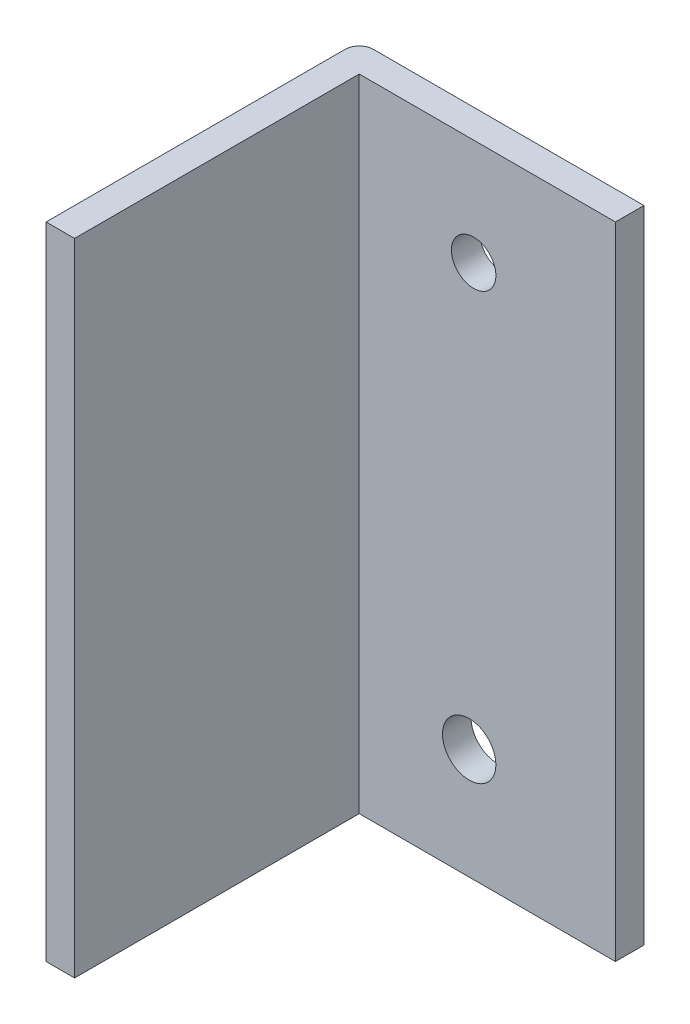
from build123d import *

# Parameters (mm, degrees)
SKETCH2_W           = 50.8
SKETCH2_H           = 114.3
BOSS_EXTRUDE1_DEPTH = 5.08
SKETCH3_W           = 50.8
SKETCH3_H           = 114.3
BOSS_EXTRUDE2_DEPTH = 5.08
FILLET1_R           = 2.54
SKETCH4_R           = 3.96875
SKETCH4_R_2         = 4.7625
CUT_EXTRUDE1_DEPTH  = 81.572467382


with BuildPart() as part:
    # Sketch2 → Boss-Extrude1 (new body)
    with BuildSketch(Plane.XY):
        Rectangle(SKETCH2_W, SKETCH2_H)
    extrude(amount=BOSS_EXTRUDE1_DEPTH)

    # Sketch3 → Boss-Extrude2 (add)
    with BuildSketch(Plane.ZY.offset(25.4)):
        with Locations((30.48, 0)):
            Rectangle(SKETCH3_W, SKETCH3_H)
    extrude(amount=-BOSS_EXTRUDE2_DEPTH)

    # Fillet1
    fillet1_edges = [part.edges().sort_by_distance(p)[0] for p in [
        (-25.4, 0, 0),
    ]]
    fillet(fillet1_edges, radius=FILLET1_R)

    # Sketch4 → Cut-Extrude1 (cut, through all)
    with BuildSketch(Plane.XY.offset(5.08)):
        with Locations((0.09525, 38.19525)):
            Circle(SKETCH4_R)
        with Locations((-0.6985, -37.4015)):
            Circle(SKETCH4_R_2)
    extrude(amount=-CUT_EXTRUDE1_DEPTH, mode=Mode.SUBTRACT)


solid = part.part
